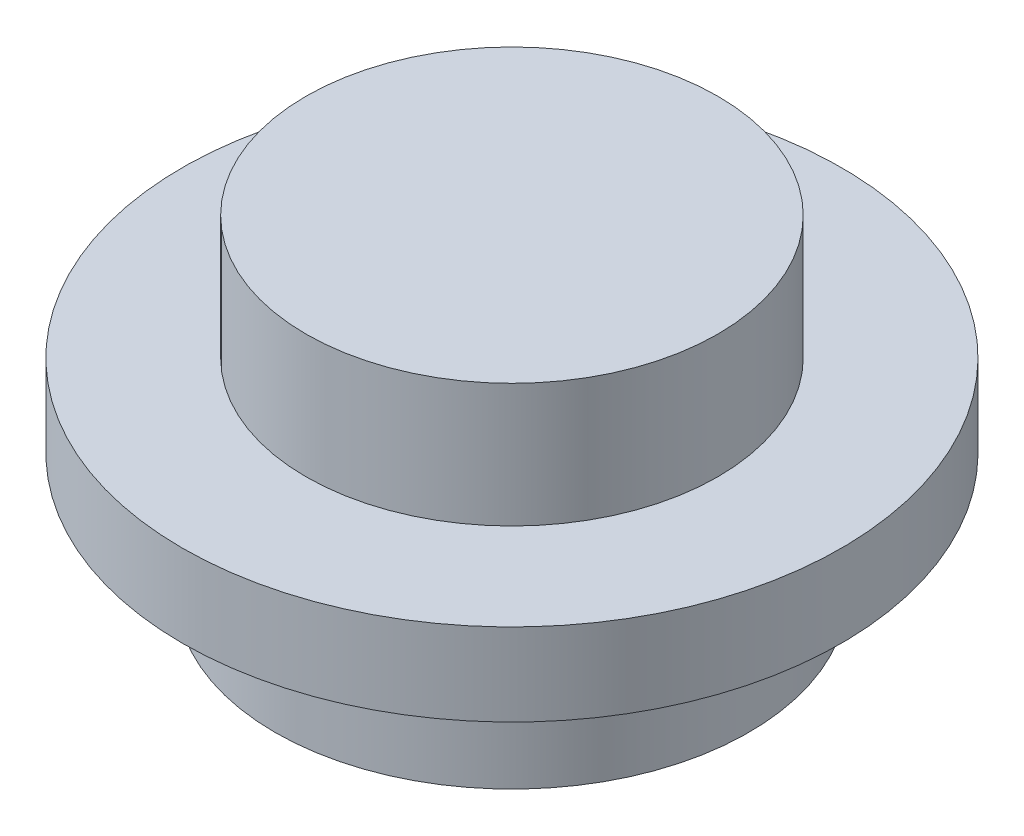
ISO-10303-21;
HEADER;
FILE_DESCRIPTION(('STEP AP214'),'2;1');
FILE_NAME('part.step','',(''),(''),'','','');
FILE_SCHEMA(('AUTOMOTIVE_DESIGN { 1 0 10303 214 1 1 1 1 }'));
ENDSEC;
DATA;
#1=APPLICATION_CONTEXT('core data for automotive mechanical design processes');
#2=APPLICATION_PROTOCOL_DEFINITION('international standard','automotive_design',2000,#1);
#3=PRODUCT_CONTEXT('',#1,'mechanical');
#4=PRODUCT('Part','Part','',(#3));
#5=PRODUCT_RELATED_PRODUCT_CATEGORY('part','',(#4));
#6=PRODUCT_DEFINITION_FORMATION('','',#4);
#7=PRODUCT_DEFINITION_CONTEXT('part definition',#1,'design');
#8=PRODUCT_DEFINITION('design','',#6,#7);
#9=PRODUCT_DEFINITION_SHAPE('','',#8);
#10=(LENGTH_UNIT() NAMED_UNIT(*) SI_UNIT(.MILLI.,.METRE.));
#11=(NAMED_UNIT(*) PLANE_ANGLE_UNIT() SI_UNIT($,.RADIAN.));
#12=(NAMED_UNIT(*) SI_UNIT($,.STERADIAN.) SOLID_ANGLE_UNIT());
#13=UNCERTAINTY_MEASURE_WITH_UNIT(LENGTH_MEASURE(1.E-05),#10,'distance_accuracy_value','');
#14=(GEOMETRIC_REPRESENTATION_CONTEXT(3) GLOBAL_UNCERTAINTY_ASSIGNED_CONTEXT((#13)) GLOBAL_UNIT_ASSIGNED_CONTEXT((#10,
#11,#12)) REPRESENTATION_CONTEXT('',''));
#15=CARTESIAN_POINT('',(0.,0.,0.));
#16=DIRECTION('',(0.,0.,1.));
#17=DIRECTION('',(1.,0.,0.));
#18=AXIS2_PLACEMENT_3D('',#15,#16,#17);
#19=CARTESIAN_POINT('',(0.,2.5,0.));
#20=DIRECTION('',(0.,1.,0.));
#21=DIRECTION('',(0.,0.,1.));
#22=AXIS2_PLACEMENT_3D('',#19,#20,#21);
#23=PLANE('',#22);
#24=CARTESIAN_POINT('',(0.,2.5,0.));
#25=DIRECTION('',(0.,1.,0.));
#26=DIRECTION('',(0.,0.,1.));
#27=AXIS2_PLACEMENT_3D('',#24,#25,#26);
#28=CIRCLE('',#27,4.);
#29=CARTESIAN_POINT('',(0.,2.5,4.));
#30=VERTEX_POINT('',#29);
#31=EDGE_CURVE('E48',#30,#30,#28,.T.);
#32=ORIENTED_EDGE('',*,*,#31,.T.);
#33=EDGE_LOOP('',(#32));
#34=FACE_BOUND('',#33,.T.);
#35=CARTESIAN_POINT('',(0.,2.5,0.));
#36=DIRECTION('',(0.,1.,0.));
#37=DIRECTION('',(0.,0.,1.));
#38=AXIS2_PLACEMENT_3D('',#35,#36,#37);
#39=CIRCLE('',#38,2.5);
#40=CARTESIAN_POINT('',(0.,2.5,2.5));
#41=VERTEX_POINT('',#40);
#42=EDGE_CURVE('E55',#41,#41,#39,.T.);
#43=ORIENTED_EDGE('',*,*,#42,.F.);
#44=EDGE_LOOP('',(#43));
#45=FACE_BOUND('',#44,.T.);
#46=ADVANCED_FACE('F30',(#34,#45),#23,.T.);
#47=CARTESIAN_POINT('',(0.,0.,0.));
#48=DIRECTION('',(0.,1.,0.));
#49=DIRECTION('',(0.,0.,1.));
#50=AXIS2_PLACEMENT_3D('',#47,#48,#49);
#51=PLANE('',#50);
#52=CARTESIAN_POINT('',(0.,0.,0.));
#53=DIRECTION('',(0.,1.,0.));
#54=DIRECTION('',(0.,0.,1.));
#55=AXIS2_PLACEMENT_3D('',#52,#53,#54);
#56=CIRCLE('',#55,2.875);
#57=CARTESIAN_POINT('',(0.,0.,2.875));
#58=VERTEX_POINT('',#57);
#59=EDGE_CURVE('E34',#58,#58,#56,.T.);
#60=ORIENTED_EDGE('',*,*,#59,.F.);
#61=EDGE_LOOP('',(#60));
#62=FACE_BOUND('',#61,.T.);
#63=CARTESIAN_POINT('',(0.,0.,0.));
#64=DIRECTION('',(0.,1.,0.));
#65=DIRECTION('',(0.,0.,1.));
#66=AXIS2_PLACEMENT_3D('',#63,#64,#65);
#67=CIRCLE('',#66,2.5);
#68=CARTESIAN_POINT('',(0.,0.,2.5));
#69=VERTEX_POINT('',#68);
#70=EDGE_CURVE('E41',#69,#69,#67,.T.);
#71=ORIENTED_EDGE('',*,*,#70,.T.);
#72=EDGE_LOOP('',(#71));
#73=FACE_BOUND('',#72,.T.);
#74=ADVANCED_FACE('F71',(#62,#73),#51,.F.);
#75=CARTESIAN_POINT('',(0.,1.5,0.));
#76=DIRECTION('',(0.,-1.,0.));
#77=DIRECTION('',(0.,0.,-1.));
#78=AXIS2_PLACEMENT_3D('',#75,#76,#77);
#79=CYLINDRICAL_SURFACE('',#78,2.875);
#80=CARTESIAN_POINT('',(0.,1.5,0.));
#81=DIRECTION('',(0.,1.,0.));
#82=DIRECTION('',(0.,0.,1.));
#83=AXIS2_PLACEMENT_3D('',#80,#81,#82);
#84=CIRCLE('',#83,2.875);
#85=CARTESIAN_POINT('',(0.,1.5,2.875));
#86=VERTEX_POINT('',#85);
#87=EDGE_CURVE('E10',#86,#86,#84,.T.);
#88=ORIENTED_EDGE('',*,*,#87,.F.);
#89=EDGE_LOOP('',(#88));
#90=FACE_BOUND('',#89,.T.);
#91=ORIENTED_EDGE('',*,*,#59,.T.);
#92=EDGE_LOOP('',(#91));
#93=FACE_BOUND('',#92,.T.);
#94=ADVANCED_FACE('F32',(#90,#93),#79,.T.);
#95=CARTESIAN_POINT('',(0.,1.5,0.));
#96=DIRECTION('',(0.,-1.,0.));
#97=DIRECTION('',(0.,0.,-1.));
#98=AXIS2_PLACEMENT_3D('',#95,#96,#97);
#99=CYLINDRICAL_SURFACE('',#98,2.5);
#100=CARTESIAN_POINT('',(0.,1.5,0.));
#101=DIRECTION('',(0.,1.,0.));
#102=DIRECTION('',(0.,0.,1.));
#103=AXIS2_PLACEMENT_3D('',#100,#101,#102);
#104=CIRCLE('',#103,2.5);
#105=CARTESIAN_POINT('',(0.,1.5,2.5));
#106=VERTEX_POINT('',#105);
#107=EDGE_CURVE('E45',#106,#106,#104,.T.);
#108=ORIENTED_EDGE('',*,*,#107,.T.);
#109=EDGE_LOOP('',(#108));
#110=FACE_BOUND('',#109,.T.);
#111=ORIENTED_EDGE('',*,*,#70,.F.);
#112=EDGE_LOOP('',(#111));
#113=FACE_BOUND('',#112,.T.);
#114=ADVANCED_FACE('F84',(#110,#113),#99,.F.);
#115=CARTESIAN_POINT('',(0.,1.5,0.));
#116=DIRECTION('',(0.,1.,0.));
#117=DIRECTION('',(0.,0.,1.));
#118=AXIS2_PLACEMENT_3D('',#115,#116,#117);
#119=PLANE('',#118);
#120=ORIENTED_EDGE('',*,*,#107,.F.);
#121=EDGE_LOOP('',(#120));
#122=FACE_BOUND('',#121,.T.);
#123=ADVANCED_FACE('F80',(#122),#119,.F.);
#124=CARTESIAN_POINT('',(0.,1.5,0.));
#125=DIRECTION('',(0.,1.,0.));
#126=DIRECTION('',(0.,0.,1.));
#127=AXIS2_PLACEMENT_3D('',#124,#125,#126);
#128=CIRCLE('',#127,4.);
#129=CARTESIAN_POINT('',(0.,1.5,4.));
#130=VERTEX_POINT('',#129);
#131=EDGE_CURVE('E49',#130,#130,#128,.T.);
#132=ORIENTED_EDGE('',*,*,#131,.F.);
#133=EDGE_LOOP('',(#132));
#134=FACE_BOUND('',#133,.T.);
#135=ORIENTED_EDGE('',*,*,#87,.T.);
#136=EDGE_LOOP('',(#135));
#137=FACE_BOUND('',#136,.T.);
#138=ADVANCED_FACE('F83',(#134,#137),#119,.F.);
#139=CARTESIAN_POINT('',(0.,2.5,0.));
#140=DIRECTION('',(0.,-1.,0.));
#141=DIRECTION('',(0.,0.,-1.));
#142=AXIS2_PLACEMENT_3D('',#139,#140,#141);
#143=CYLINDRICAL_SURFACE('',#142,4.);
#144=ORIENTED_EDGE('',*,*,#31,.F.);
#145=EDGE_LOOP('',(#144));
#146=FACE_BOUND('',#145,.T.);
#147=ORIENTED_EDGE('',*,*,#131,.T.);
#148=EDGE_LOOP('',(#147));
#149=FACE_BOUND('',#148,.T.);
#150=ADVANCED_FACE('F66',(#146,#149),#143,.T.);
#151=CARTESIAN_POINT('',(0.,4.,0.));
#152=DIRECTION('',(0.,-1.,0.));
#153=DIRECTION('',(0.,0.,-1.));
#154=AXIS2_PLACEMENT_3D('',#151,#152,#153);
#155=CYLINDRICAL_SURFACE('',#154,2.5);
#156=CARTESIAN_POINT('',(0.,4.,0.));
#157=DIRECTION('',(0.,1.,0.));
#158=DIRECTION('',(0.,0.,1.));
#159=AXIS2_PLACEMENT_3D('',#156,#157,#158);
#160=CIRCLE('',#159,2.5);
#161=CARTESIAN_POINT('',(0.,4.,2.5));
#162=VERTEX_POINT('',#161);
#163=EDGE_CURVE('E52',#162,#162,#160,.T.);
#164=ORIENTED_EDGE('',*,*,#163,.F.);
#165=EDGE_LOOP('',(#164));
#166=FACE_BOUND('',#165,.T.);
#167=ORIENTED_EDGE('',*,*,#42,.T.);
#168=EDGE_LOOP('',(#167));
#169=FACE_BOUND('',#168,.T.);
#170=ADVANCED_FACE('F63',(#166,#169),#155,.T.);
#171=CARTESIAN_POINT('',(0.,4.,0.));
#172=DIRECTION('',(0.,1.,0.));
#173=DIRECTION('',(0.,0.,1.));
#174=AXIS2_PLACEMENT_3D('',#171,#172,#173);
#175=PLANE('',#174);
#176=ORIENTED_EDGE('',*,*,#163,.T.);
#177=EDGE_LOOP('',(#176));
#178=FACE_BOUND('',#177,.T.);
#179=ADVANCED_FACE('F61',(#178),#175,.T.);
#180=CLOSED_SHELL('',(#46,#74,#94,#114,#123,#138,#150,#170,#179));
#181=MANIFOLD_SOLID_BREP('B2',#180);
#182=ADVANCED_BREP_SHAPE_REPRESENTATION('',(#18,#181),#14);
#183=SHAPE_DEFINITION_REPRESENTATION(#9,#182);
ENDSEC;
END-ISO-10303-21;
